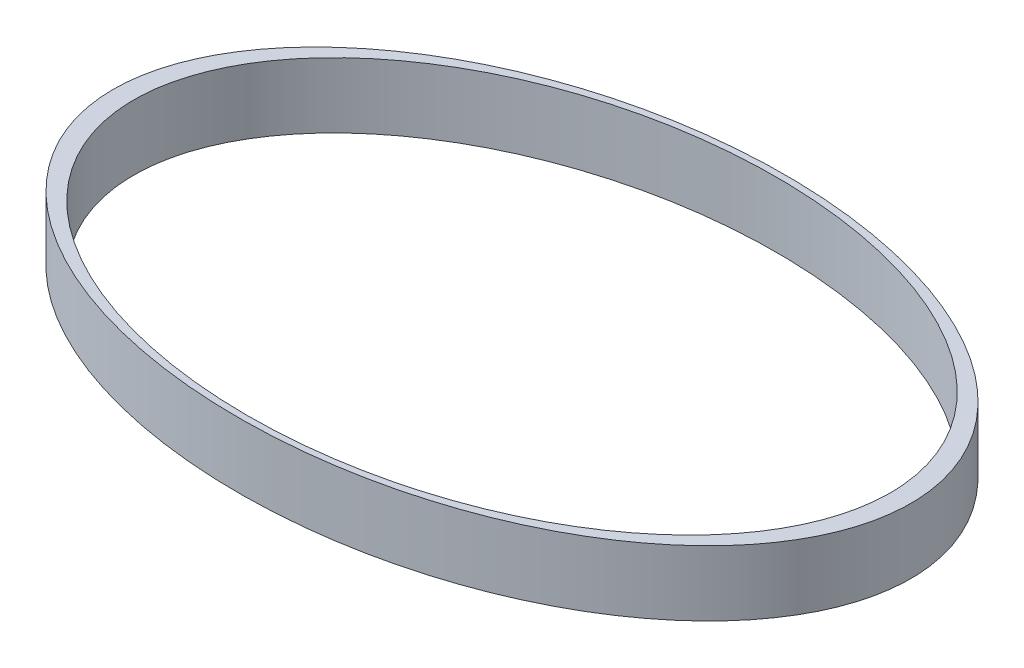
from build123d import *

# Parameters (mm, degrees)
SKETCH1_RX          = 58.220514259
SKETCH1_RY          = 36.871023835
SKETCH1_RX_2        = 55.240939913
SKETCH1_RY_2        = 35.920911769
BOSS_EXTRUDE1_DEPTH = 10


with BuildPart() as part:
    # Sketch1 → Boss-Extrude1 (new body)
    with BuildSketch(Plane(origin=(0, 0, 0), x_dir=(1, 0, 0), z_dir=(0, 1, 0))):
        with Locations(Location((181.503291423, -2.138936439), (0, 0, -174.88942694))):
            Ellipse(SKETCH1_RX, SKETCH1_RY)
        with Locations(Location((181.503291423, -2.138936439), (0, 0, 5.246122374))):
            Ellipse(SKETCH1_RX_2, SKETCH1_RY_2, mode=Mode.SUBTRACT)
    extrude(amount=BOSS_EXTRUDE1_DEPTH)


solid = part.part
